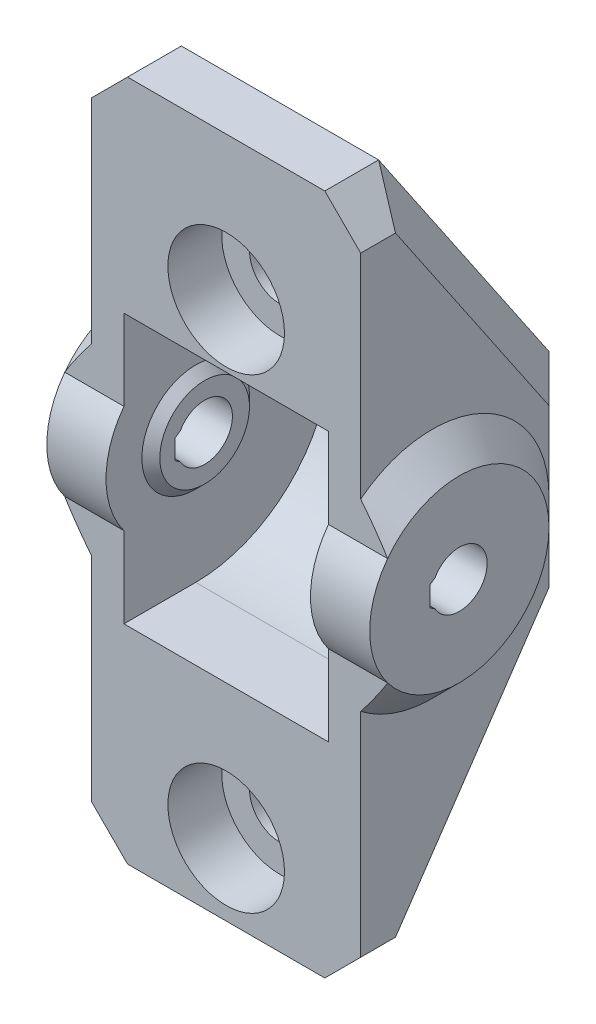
ISO-10303-21;
HEADER;
FILE_DESCRIPTION(('STEP AP214'),'2;1');
FILE_NAME('part.step','',(''),(''),'','','');
FILE_SCHEMA(('AUTOMOTIVE_DESIGN { 1 0 10303 214 1 1 1 1 }'));
ENDSEC;
DATA;
#1=APPLICATION_CONTEXT('core data for automotive mechanical design processes');
#2=APPLICATION_PROTOCOL_DEFINITION('international standard','automotive_design',2000,#1);
#3=PRODUCT_CONTEXT('',#1,'mechanical');
#4=PRODUCT('Part','Part','',(#3));
#5=PRODUCT_RELATED_PRODUCT_CATEGORY('part','',(#4));
#6=PRODUCT_DEFINITION_FORMATION('','',#4);
#7=PRODUCT_DEFINITION_CONTEXT('part definition',#1,'design');
#8=PRODUCT_DEFINITION('design','',#6,#7);
#9=PRODUCT_DEFINITION_SHAPE('','',#8);
#10=(LENGTH_UNIT() NAMED_UNIT(*) SI_UNIT(.MILLI.,.METRE.));
#11=(NAMED_UNIT(*) PLANE_ANGLE_UNIT() SI_UNIT($,.RADIAN.));
#12=(NAMED_UNIT(*) SI_UNIT($,.STERADIAN.) SOLID_ANGLE_UNIT());
#13=UNCERTAINTY_MEASURE_WITH_UNIT(LENGTH_MEASURE(1.E-05),#10,'distance_accuracy_value','');
#14=(GEOMETRIC_REPRESENTATION_CONTEXT(3) GLOBAL_UNCERTAINTY_ASSIGNED_CONTEXT((#13)) GLOBAL_UNIT_ASSIGNED_CONTEXT((#10,
#11,#12)) REPRESENTATION_CONTEXT('',''));
#15=CARTESIAN_POINT('',(0.,0.,0.));
#16=DIRECTION('',(0.,0.,1.));
#17=DIRECTION('',(1.,0.,0.));
#18=AXIS2_PLACEMENT_3D('',#15,#16,#17);
#19=CARTESIAN_POINT('',(7.5,19.,16.));
#20=DIRECTION('',(-1.,0.,0.));
#21=DIRECTION('',(0.,-1.,0.));
#22=AXIS2_PLACEMENT_3D('',#19,#20,#21);
#23=PLANE('',#22);
#24=DIRECTION('',(0.,0.827475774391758,0.561501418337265));
#25=VECTOR('',#24,1.);
#26=CARTESIAN_POINT('',(7.5,19.2708836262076,15.6008030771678));
#27=LINE('',#26,#25);
#28=CARTESIAN_POINT('',(7.5,4.38548961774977,5.49999999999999));
#29=VERTEX_POINT('',#28);
#30=CARTESIAN_POINT('',(7.5,17.,14.0598463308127));
#31=VERTEX_POINT('',#30);
#32=EDGE_CURVE('E516',#29,#31,#27,.T.);
#33=ORIENTED_EDGE('',*,*,#32,.T.);
#34=DIRECTION('',(0.,0.,1.));
#35=VECTOR('',#34,1.);
#36=CARTESIAN_POINT('',(7.5,17.,16.));
#37=LINE('',#36,#35);
#38=CARTESIAN_POINT('',(7.5,17.,16.));
#39=VERTEX_POINT('',#38);
#40=EDGE_CURVE('E518',#31,#39,#37,.T.);
#41=ORIENTED_EDGE('',*,*,#40,.T.);
#42=DIRECTION('',(0.,1.,0.));
#43=VECTOR('',#42,1.);
#44=CARTESIAN_POINT('',(7.5,19.,16.));
#45=LINE('',#44,#43);
#46=CARTESIAN_POINT('',(7.5,5.12347538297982,16.));
#47=VERTEX_POINT('',#46);
#48=EDGE_CURVE('E389',#47,#39,#45,.T.);
#49=ORIENTED_EDGE('',*,*,#48,.F.);
#50=CARTESIAN_POINT('',(7.5,0.,12.));
#51=DIRECTION('',(-1.,0.,0.));
#52=DIRECTION('',(0.,-1.,0.));
#53=AXIS2_PLACEMENT_3D('',#50,#51,#52);
#54=CIRCLE('',#53,6.50000000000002);
#55=CARTESIAN_POINT('',(7.5,0.,5.49999999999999));
#56=VERTEX_POINT('',#55);
#57=EDGE_CURVE('E409',#47,#56,#54,.T.);
#58=ORIENTED_EDGE('',*,*,#57,.T.);
#59=DIRECTION('',(0.,1.,0.));
#60=VECTOR('',#59,1.);
#61=CARTESIAN_POINT('',(7.5,19.,5.49999999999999));
#62=LINE('',#61,#60);
#63=EDGE_CURVE('E514',#56,#29,#62,.T.);
#64=ORIENTED_EDGE('',*,*,#63,.T.);
#65=EDGE_LOOP('',(#33,#41,#49,#58,#64));
#66=FACE_BOUND('',#65,.T.);
#67=ADVANCED_FACE('F39',(#66),#23,.F.);
#68=CARTESIAN_POINT('',(-7.5,19.,16.));
#69=DIRECTION('',(1.,0.,0.));
#70=DIRECTION('',(0.,1.,0.));
#71=AXIS2_PLACEMENT_3D('',#68,#69,#70);
#72=PLANE('',#71);
#73=DIRECTION('',(0.,-0.827475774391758,0.561501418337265));
#74=VECTOR('',#73,1.);
#75=CARTESIAN_POINT('',(-7.49999999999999,-17.8769971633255,14.6549515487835));
#76=LINE('',#75,#74);
#77=CARTESIAN_POINT('',(-7.5,-4.38548961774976,5.5));
#78=VERTEX_POINT('',#77);
#79=CARTESIAN_POINT('',(-7.49999999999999,-17.,14.0598463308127));
#80=VERTEX_POINT('',#79);
#81=EDGE_CURVE('E479',#78,#80,#76,.T.);
#82=ORIENTED_EDGE('',*,*,#81,.T.);
#83=DIRECTION('',(0.,0.,1.));
#84=VECTOR('',#83,1.);
#85=CARTESIAN_POINT('',(-7.49999999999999,-17.,16.));
#86=LINE('',#85,#84);
#87=CARTESIAN_POINT('',(-7.49999999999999,-17.,16.));
#88=VERTEX_POINT('',#87);
#89=EDGE_CURVE('E481',#80,#88,#86,.T.);
#90=ORIENTED_EDGE('',*,*,#89,.T.);
#91=DIRECTION('',(0.,-1.,0.));
#92=VECTOR('',#91,1.);
#93=CARTESIAN_POINT('',(-7.5,19.,16.));
#94=LINE('',#93,#92);
#95=CARTESIAN_POINT('',(-7.5,-5.12347538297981,16.));
#96=VERTEX_POINT('',#95);
#97=EDGE_CURVE('E376',#96,#88,#94,.T.);
#98=ORIENTED_EDGE('',*,*,#97,.F.);
#99=CARTESIAN_POINT('',(-7.5,0.,12.));
#100=DIRECTION('',(1.,0.,0.));
#101=DIRECTION('',(0.,1.,0.));
#102=AXIS2_PLACEMENT_3D('',#99,#100,#101);
#103=CIRCLE('',#102,6.50000000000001);
#104=CARTESIAN_POINT('',(-7.5,0.,5.5));
#105=VERTEX_POINT('',#104);
#106=EDGE_CURVE('E413',#96,#105,#103,.T.);
#107=ORIENTED_EDGE('',*,*,#106,.T.);
#108=DIRECTION('',(0.,-1.,0.));
#109=VECTOR('',#108,1.);
#110=CARTESIAN_POINT('',(-7.5,19.,5.5));
#111=LINE('',#110,#109);
#112=EDGE_CURVE('E477',#105,#78,#111,.T.);
#113=ORIENTED_EDGE('',*,*,#112,.T.);
#114=EDGE_LOOP('',(#82,#90,#98,#107,#113));
#115=FACE_BOUND('',#114,.T.);
#116=ADVANCED_FACE('F585',(#115),#72,.F.);
#117=CARTESIAN_POINT('',(0.,0.,16.));
#118=DIRECTION('',(0.,0.,-1.));
#119=DIRECTION('',(-1.,0.,0.));
#120=AXIS2_PLACEMENT_3D('',#117,#118,#119);
#121=PLANE('',#120);
#122=CARTESIAN_POINT('',(0.,11.,16.));
#123=DIRECTION('',(0.,0.,1.));
#124=DIRECTION('',(1.,0.,0.));
#125=AXIS2_PLACEMENT_3D('',#122,#123,#124);
#126=CIRCLE('',#125,3.25);
#127=CARTESIAN_POINT('',(3.25,11.,16.));
#128=VERTEX_POINT('',#127);
#129=EDGE_CURVE('E321',#128,#128,#126,.T.);
#130=ORIENTED_EDGE('',*,*,#129,.F.);
#131=EDGE_LOOP('',(#130));
#132=FACE_BOUND('',#131,.T.);
#133=DIRECTION('',(-1.,0.,0.));
#134=VECTOR('',#133,1.);
#135=CARTESIAN_POINT('',(7.5,19.,16.));
#136=LINE('',#135,#134);
#137=CARTESIAN_POINT('',(5.5,19.,16.));
#138=VERTEX_POINT('',#137);
#139=CARTESIAN_POINT('',(-5.49999999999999,19.,16.));
#140=VERTEX_POINT('',#139);
#141=EDGE_CURVE('E393',#138,#140,#136,.T.);
#142=ORIENTED_EDGE('',*,*,#141,.T.);
#143=DIRECTION('',(0.707106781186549,0.707106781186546,0.));
#144=VECTOR('',#143,1.);
#145=CARTESIAN_POINT('',(-7.5,17.,16.));
#146=LINE('',#145,#144);
#147=CARTESIAN_POINT('',(-7.5,17.,16.));
#148=VERTEX_POINT('',#147);
#149=EDGE_CURVE('E506',#140,#148,#146,.F.);
#150=ORIENTED_EDGE('',*,*,#149,.T.);
#151=CARTESIAN_POINT('',(-7.5,5.12347538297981,16.));
#152=VERTEX_POINT('',#151);
#153=EDGE_CURVE('E384',#148,#152,#94,.T.);
#154=ORIENTED_EDGE('',*,*,#153,.T.);
#155=CARTESIAN_POINT('',(-7.5,5.12347538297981,16.));
#156=CARTESIAN_POINT('',(-7.56711714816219,5.03832196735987,16.));
#157=CARTESIAN_POINT('',(-7.63384766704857,4.9528635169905,16.));
#158=CARTESIAN_POINT('',(-7.76642428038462,4.78125929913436,16.));
#159=CARTESIAN_POINT('',(-7.83227034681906,4.6951135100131,16.));
#160=CARTESIAN_POINT('',(-8.02817951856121,4.43570850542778,16.));
#161=CARTESIAN_POINT('',(-8.15674680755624,4.26131350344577,16.));
#162=CARTESIAN_POINT('',(-8.40870004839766,3.90869296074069,16.));
#163=CARTESIAN_POINT('',(-8.53208403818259,3.73046600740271,16.));
#164=CARTESIAN_POINT('',(-8.71192373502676,3.45952365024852,16.));
#165=CARTESIAN_POINT('',(-8.77102477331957,3.36856455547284,16.));
#166=CARTESIAN_POINT('',(-8.88715085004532,3.18531455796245,16.));
#167=CARTESIAN_POINT('',(-8.94417559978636,3.09302347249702,16.));
#168=CARTESIAN_POINT('',(-8.99999999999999,2.99999999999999,16.));
#169=B_SPLINE_CURVE_WITH_KNOTS('',3,(#155,#156,#157,#158,#159,#160,#161,#162,#163,#164,#165,
#166,#167,#168),.UNSPECIFIED.,.F.,.F.,(4,2,2,2,2,2,4),(0.,0.325271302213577,0.650552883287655,
1.30047262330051,1.95063620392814,2.27603142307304,2.60147171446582),.UNSPECIFIED.);
#170=CARTESIAN_POINT('',(-9.,2.99999999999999,16.));
#171=VERTEX_POINT('',#170);
#172=EDGE_CURVE('E454',#152,#171,#169,.T.);
#173=ORIENTED_EDGE('',*,*,#172,.T.);
#174=DIRECTION('',(1.,0.,0.));
#175=VECTOR('',#174,1.);
#176=CARTESIAN_POINT('',(-32.1421356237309,2.99999999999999,16.));
#177=LINE('',#176,#175);
#178=CARTESIAN_POINT('',(-5.7,2.99999999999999,16.));
#179=VERTEX_POINT('',#178);
#180=EDGE_CURVE('E290',#171,#179,#177,.T.);
#181=ORIENTED_EDGE('',*,*,#180,.T.);
#182=DIRECTION('',(0.,-1.,0.));
#183=VECTOR('',#182,1.);
#184=CARTESIAN_POINT('',(-5.7,7.5,16.));
#185=LINE('',#184,#183);
#186=CARTESIAN_POINT('',(-5.7,7.5,16.));
#187=VERTEX_POINT('',#186);
#188=EDGE_CURVE('E357',#187,#179,#185,.T.);
#189=ORIENTED_EDGE('',*,*,#188,.F.);
#190=DIRECTION('',(1.,0.,0.));
#191=VECTOR('',#190,1.);
#192=CARTESIAN_POINT('',(-5.7,7.5,16.));
#193=LINE('',#192,#191);
#194=CARTESIAN_POINT('',(5.7,7.5,16.));
#195=VERTEX_POINT('',#194);
#196=EDGE_CURVE('E380',#187,#195,#193,.T.);
#197=ORIENTED_EDGE('',*,*,#196,.T.);
#198=DIRECTION('',(0.,-1.,0.));
#199=VECTOR('',#198,1.);
#200=CARTESIAN_POINT('',(5.7,7.5,16.));
#201=LINE('',#200,#199);
#202=CARTESIAN_POINT('',(5.7,2.99999999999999,16.));
#203=VERTEX_POINT('',#202);
#204=EDGE_CURVE('E370',#195,#203,#201,.T.);
#205=ORIENTED_EDGE('',*,*,#204,.T.);
#206=DIRECTION('',(-1.,0.,0.));
#207=VECTOR('',#206,1.);
#208=CARTESIAN_POINT('',(32.1421356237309,2.99999999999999,16.));
#209=LINE('',#208,#207);
#210=CARTESIAN_POINT('',(9.,2.99999999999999,16.));
#211=VERTEX_POINT('',#210);
#212=EDGE_CURVE('E300',#203,#211,#209,.F.);
#213=ORIENTED_EDGE('',*,*,#212,.T.);
#214=CARTESIAN_POINT('',(9.00000000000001,2.99999999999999,16.));
#215=CARTESIAN_POINT('',(8.94417559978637,3.09302347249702,16.));
#216=CARTESIAN_POINT('',(8.88715085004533,3.18531455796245,16.));
#217=CARTESIAN_POINT('',(8.77102477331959,3.36856455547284,16.));
#218=CARTESIAN_POINT('',(8.71192373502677,3.45952365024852,16.));
#219=CARTESIAN_POINT('',(8.5320840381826,3.73046600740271,16.));
#220=CARTESIAN_POINT('',(8.40870004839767,3.90869296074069,16.));
#221=CARTESIAN_POINT('',(8.15674680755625,4.26131350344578,16.));
#222=CARTESIAN_POINT('',(8.02817951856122,4.43570850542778,16.));
#223=CARTESIAN_POINT('',(7.83227034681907,4.6951135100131,16.));
#224=CARTESIAN_POINT('',(7.76642428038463,4.78125929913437,16.));
#225=CARTESIAN_POINT('',(7.63384766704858,4.95286351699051,16.));
#226=CARTESIAN_POINT('',(7.5671171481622,5.03832196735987,16.));
#227=CARTESIAN_POINT('',(7.5,5.12347538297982,16.));
#228=B_SPLINE_CURVE_WITH_KNOTS('',3,(#214,#215,#216,#217,#218,#219,#220,#221,#222,#223,#224,
#225,#226,#227),.UNSPECIFIED.,.F.,.F.,(4,2,2,2,2,2,4),(0.,0.325440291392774,0.650835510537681,
1.30099909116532,1.95091883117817,2.27620041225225,2.60147171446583),.UNSPECIFIED.);
#229=EDGE_CURVE('E425',#211,#47,#228,.T.);
#230=ORIENTED_EDGE('',*,*,#229,.T.);
#231=ORIENTED_EDGE('',*,*,#48,.T.);
#232=DIRECTION('',(0.707106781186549,-0.707106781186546,0.));
#233=VECTOR('',#232,1.);
#234=CARTESIAN_POINT('',(5.5,19.,16.));
#235=LINE('',#234,#233);
#236=EDGE_CURVE('E504',#39,#138,#235,.F.);
#237=ORIENTED_EDGE('',*,*,#236,.T.);
#238=EDGE_LOOP('',(#142,#150,#154,#173,#181,#189,#197,#205,#213,#230,#231,#237));
#239=FACE_BOUND('',#238,.T.);
#240=ADVANCED_FACE('F592',(#132,#239),#121,.F.);
#241=DIRECTION('',(0.,-0.827475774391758,-0.561501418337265));
#242=VECTOR('',#241,1.);
#243=CARTESIAN_POINT('',(-7.5,19.2708836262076,15.6008030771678));
#244=LINE('',#243,#242);
#245=CARTESIAN_POINT('',(-7.5,17.,14.0598463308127));
#246=VERTEX_POINT('',#245);
#247=CARTESIAN_POINT('',(-7.5,4.38548961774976,5.5));
#248=VERTEX_POINT('',#247);
#249=EDGE_CURVE('E473',#246,#248,#244,.T.);
#250=ORIENTED_EDGE('',*,*,#249,.T.);
#251=DIRECTION('',(0.,-1.,0.));
#252=VECTOR('',#251,1.);
#253=CARTESIAN_POINT('',(-7.5,19.,5.5));
#254=LINE('',#253,#252);
#255=EDGE_CURVE('E475',#248,#105,#254,.T.);
#256=ORIENTED_EDGE('',*,*,#255,.T.);
#257=EDGE_CURVE('E412',#105,#152,#103,.T.);
#258=ORIENTED_EDGE('',*,*,#257,.T.);
#259=ORIENTED_EDGE('',*,*,#153,.F.);
#260=DIRECTION('',(0.,0.,-1.));
#261=VECTOR('',#260,1.);
#262=CARTESIAN_POINT('',(-7.5,17.,16.));
#263=LINE('',#262,#261);
#264=EDGE_CURVE('E471',#148,#246,#263,.T.);
#265=ORIENTED_EDGE('',*,*,#264,.T.);
#266=EDGE_LOOP('',(#250,#256,#258,#259,#265));
#267=FACE_BOUND('',#266,.T.);
#268=ADVANCED_FACE('F595',(#267),#72,.F.);
#269=CARTESIAN_POINT('',(7.50000000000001,-19.,16.));
#270=DIRECTION('',(0.,1.,0.));
#271=DIRECTION('',(-1.,0.,0.));
#272=AXIS2_PLACEMENT_3D('',#269,#270,#271);
#273=PLANE('',#272);
#274=DIRECTION('',(1.,0.,0.));
#275=VECTOR('',#274,1.);
#276=CARTESIAN_POINT('',(7.50000000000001,-19.,16.));
#277=LINE('',#276,#275);
#278=CARTESIAN_POINT('',(-5.49999999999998,-19.,16.));
#279=VERTEX_POINT('',#278);
#280=CARTESIAN_POINT('',(5.5,-19.,16.));
#281=VERTEX_POINT('',#280);
#282=EDGE_CURVE('E386',#279,#281,#277,.T.);
#283=ORIENTED_EDGE('',*,*,#282,.F.);
#284=DIRECTION('',(0.,0.,-1.));
#285=VECTOR('',#284,1.);
#286=CARTESIAN_POINT('',(-5.49999999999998,-19.,16.));
#287=LINE('',#286,#285);
#288=CARTESIAN_POINT('',(-5.49999999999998,-19.,13.));
#289=VERTEX_POINT('',#288);
#290=EDGE_CURVE('E468',#279,#289,#287,.T.);
#291=ORIENTED_EDGE('',*,*,#290,.T.);
#292=DIRECTION('',(1.,0.,0.));
#293=VECTOR('',#292,1.);
#294=CARTESIAN_POINT('',(-7.5,-19.,13.));
#295=LINE('',#294,#293);
#296=CARTESIAN_POINT('',(5.5,-19.,13.));
#297=VERTEX_POINT('',#296);
#298=EDGE_CURVE('E308',#289,#297,#295,.T.);
#299=ORIENTED_EDGE('',*,*,#298,.T.);
#300=DIRECTION('',(0.,0.,1.));
#301=VECTOR('',#300,1.);
#302=CARTESIAN_POINT('',(5.5,-19.,16.));
#303=LINE('',#302,#301);
#304=EDGE_CURVE('E466',#297,#281,#303,.T.);
#305=ORIENTED_EDGE('',*,*,#304,.T.);
#306=EDGE_LOOP('',(#283,#291,#299,#305));
#307=FACE_BOUND('',#306,.T.);
#308=ADVANCED_FACE('F599',(#307),#273,.F.);
#309=DIRECTION('',(0.,0.827475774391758,-0.561501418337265));
#310=VECTOR('',#309,1.);
#311=CARTESIAN_POINT('',(7.5,-3.87699716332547,5.15495154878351));
#312=LINE('',#311,#310);
#313=CARTESIAN_POINT('',(7.50000000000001,-17.,14.0598463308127));
#314=VERTEX_POINT('',#313);
#315=CARTESIAN_POINT('',(7.5,-4.38548961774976,5.49999999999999));
#316=VERTEX_POINT('',#315);
#317=EDGE_CURVE('E510',#314,#316,#312,.T.);
#318=ORIENTED_EDGE('',*,*,#317,.T.);
#319=DIRECTION('',(0.,1.,0.));
#320=VECTOR('',#319,1.);
#321=CARTESIAN_POINT('',(7.5,19.,5.49999999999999));
#322=LINE('',#321,#320);
#323=EDGE_CURVE('E512',#316,#56,#322,.T.);
#324=ORIENTED_EDGE('',*,*,#323,.T.);
#325=CARTESIAN_POINT('',(7.5,-5.12347538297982,16.));
#326=VERTEX_POINT('',#325);
#327=EDGE_CURVE('E402',#56,#326,#54,.T.);
#328=ORIENTED_EDGE('',*,*,#327,.T.);
#329=CARTESIAN_POINT('',(7.50000000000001,-17.,16.));
#330=VERTEX_POINT('',#329);
#331=EDGE_CURVE('E390',#330,#326,#45,.T.);
#332=ORIENTED_EDGE('',*,*,#331,.F.);
#333=DIRECTION('',(0.,0.,-1.));
#334=VECTOR('',#333,1.);
#335=CARTESIAN_POINT('',(7.50000000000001,-17.,16.));
#336=LINE('',#335,#334);
#337=EDGE_CURVE('E508',#330,#314,#336,.T.);
#338=ORIENTED_EDGE('',*,*,#337,.T.);
#339=EDGE_LOOP('',(#318,#324,#328,#332,#338));
#340=FACE_BOUND('',#339,.T.);
#341=ADVANCED_FACE('F588',(#340),#23,.F.);
#342=CARTESIAN_POINT('',(0.,-15.,16.));
#343=DIRECTION('',(0.,0.,1.));
#344=DIRECTION('',(1.,0.,0.));
#345=AXIS2_PLACEMENT_3D('',#342,#343,#344);
#346=CYLINDRICAL_SURFACE('',#345,1.7);
#347=CARTESIAN_POINT('',(0.,-15.,13.));
#348=DIRECTION('',(0.,0.,1.));
#349=DIRECTION('',(1.,0.,0.));
#350=AXIS2_PLACEMENT_3D('',#347,#348,#349);
#351=CIRCLE('',#350,1.7);
#352=CARTESIAN_POINT('',(1.7,-15.,13.));
#353=VERTEX_POINT('',#352);
#354=EDGE_CURVE('E336',#353,#353,#351,.T.);
#355=ORIENTED_EDGE('',*,*,#354,.T.);
#356=EDGE_LOOP('',(#355));
#357=FACE_BOUND('',#356,.T.);
#358=CARTESIAN_POINT('',(0.,-15.,10.2857142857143));
#359=DIRECTION('',(0.,-0.561501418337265,-0.827475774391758));
#360=DIRECTION('',(0.,-0.827475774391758,0.561501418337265));
#361=AXIS2_PLACEMENT_3D('',#358,#359,#360);
#362=ELLIPSE('',#361,2.05444080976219,1.7);
#363=CARTESIAN_POINT('',(0.,-16.7,11.4392857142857));
#364=VERTEX_POINT('',#363);
#365=EDGE_CURVE('E311',#364,#364,#362,.F.);
#366=ORIENTED_EDGE('',*,*,#365,.F.);
#367=EDGE_LOOP('',(#366));
#368=FACE_BOUND('',#367,.T.);
#369=ADVANCED_FACE('F598',(#357,#368),#346,.F.);
#370=CARTESIAN_POINT('',(0.,-15.,16.));
#371=DIRECTION('',(0.,0.,1.));
#372=DIRECTION('',(1.,0.,0.));
#373=AXIS2_PLACEMENT_3D('',#370,#371,#372);
#374=CIRCLE('',#373,3.25);
#375=CARTESIAN_POINT('',(3.25,-15.,16.));
#376=VERTEX_POINT('',#375);
#377=EDGE_CURVE('E330',#376,#376,#374,.T.);
#378=ORIENTED_EDGE('',*,*,#377,.F.);
#379=EDGE_LOOP('',(#378));
#380=FACE_BOUND('',#379,.T.);
#381=ORIENTED_EDGE('',*,*,#97,.T.);
#382=DIRECTION('',(-0.707106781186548,0.707106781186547,0.));
#383=VECTOR('',#382,1.);
#384=CARTESIAN_POINT('',(-5.49999999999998,-19.,16.));
#385=LINE('',#384,#383);
#386=EDGE_CURVE('E485',#88,#279,#385,.F.);
#387=ORIENTED_EDGE('',*,*,#386,.T.);
#388=ORIENTED_EDGE('',*,*,#282,.T.);
#389=DIRECTION('',(-0.707106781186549,-0.707106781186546,0.));
#390=VECTOR('',#389,1.);
#391=CARTESIAN_POINT('',(7.50000000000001,-17.,16.));
#392=LINE('',#391,#390);
#393=EDGE_CURVE('E483',#281,#330,#392,.F.);
#394=ORIENTED_EDGE('',*,*,#393,.T.);
#395=ORIENTED_EDGE('',*,*,#331,.T.);
#396=CARTESIAN_POINT('',(7.5,-5.12347538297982,16.));
#397=CARTESIAN_POINT('',(7.5671171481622,-5.03832196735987,16.));
#398=CARTESIAN_POINT('',(7.63384766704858,-4.95286351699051,16.));
#399=CARTESIAN_POINT('',(7.76642428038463,-4.78125929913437,16.));
#400=CARTESIAN_POINT('',(7.83227034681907,-4.6951135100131,16.));
#401=CARTESIAN_POINT('',(8.02817951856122,-4.43570850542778,16.));
#402=CARTESIAN_POINT('',(8.15674680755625,-4.26131350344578,16.));
#403=CARTESIAN_POINT('',(8.40870004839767,-3.90869296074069,16.));
#404=CARTESIAN_POINT('',(8.5320840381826,-3.73046600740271,16.));
#405=CARTESIAN_POINT('',(8.71192373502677,-3.45952365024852,16.));
#406=CARTESIAN_POINT('',(8.77102477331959,-3.36856455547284,16.));
#407=CARTESIAN_POINT('',(8.88715085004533,-3.18531455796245,16.));
#408=CARTESIAN_POINT('',(8.94417559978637,-3.09302347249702,16.));
#409=CARTESIAN_POINT('',(9.00000000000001,-2.99999999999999,16.));
#410=B_SPLINE_CURVE_WITH_KNOTS('',3,(#396,#397,#398,#399,#400,#401,#402,#403,#404,#405,#406,
#407,#408,#409),.UNSPECIFIED.,.F.,.F.,(4,2,2,2,2,2,4),(0.,0.32527130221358,0.650552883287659,
1.30047262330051,1.95063620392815,2.27603142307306,2.60147171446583),.UNSPECIFIED.);
#411=CARTESIAN_POINT('',(9.,-2.99999999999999,16.));
#412=VERTEX_POINT('',#411);
#413=EDGE_CURVE('E416',#326,#412,#410,.T.);
#414=ORIENTED_EDGE('',*,*,#413,.T.);
#415=DIRECTION('',(-1.,0.,0.));
#416=VECTOR('',#415,1.);
#417=CARTESIAN_POINT('',(32.1421356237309,-2.99999999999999,16.));
#418=LINE('',#417,#416);
#419=CARTESIAN_POINT('',(5.7,-2.99999999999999,16.));
#420=VERTEX_POINT('',#419);
#421=EDGE_CURVE('E304',#412,#420,#418,.T.);
#422=ORIENTED_EDGE('',*,*,#421,.T.);
#423=CARTESIAN_POINT('',(5.7,-7.5,16.));
#424=VERTEX_POINT('',#423);
#425=EDGE_CURVE('E369',#420,#424,#201,.T.);
#426=ORIENTED_EDGE('',*,*,#425,.T.);
#427=DIRECTION('',(1.,0.,0.));
#428=VECTOR('',#427,1.);
#429=CARTESIAN_POINT('',(-5.7,-7.5,16.));
#430=LINE('',#429,#428);
#431=CARTESIAN_POINT('',(-5.7,-7.5,16.));
#432=VERTEX_POINT('',#431);
#433=EDGE_CURVE('E377',#432,#424,#430,.T.);
#434=ORIENTED_EDGE('',*,*,#433,.F.);
#435=CARTESIAN_POINT('',(-5.7,-2.99999999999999,16.));
#436=VERTEX_POINT('',#435);
#437=EDGE_CURVE('E356',#436,#432,#185,.T.);
#438=ORIENTED_EDGE('',*,*,#437,.F.);
#439=DIRECTION('',(1.,0.,0.));
#440=VECTOR('',#439,1.);
#441=CARTESIAN_POINT('',(-32.1421356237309,-2.99999999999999,16.));
#442=LINE('',#441,#440);
#443=CARTESIAN_POINT('',(-9.,-2.99999999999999,16.));
#444=VERTEX_POINT('',#443);
#445=EDGE_CURVE('E288',#436,#444,#442,.F.);
#446=ORIENTED_EDGE('',*,*,#445,.T.);
#447=CARTESIAN_POINT('',(-8.99999999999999,-2.99999999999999,16.));
#448=CARTESIAN_POINT('',(-8.94417559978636,-3.09302347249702,16.));
#449=CARTESIAN_POINT('',(-8.88715085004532,-3.18531455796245,16.));
#450=CARTESIAN_POINT('',(-8.77102477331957,-3.36856455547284,16.));
#451=CARTESIAN_POINT('',(-8.71192373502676,-3.45952365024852,16.));
#452=CARTESIAN_POINT('',(-8.53208403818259,-3.73046600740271,16.));
#453=CARTESIAN_POINT('',(-8.40870004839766,-3.90869296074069,16.));
#454=CARTESIAN_POINT('',(-8.15674680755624,-4.26131350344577,16.));
#455=CARTESIAN_POINT('',(-8.02817951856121,-4.43570850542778,16.));
#456=CARTESIAN_POINT('',(-7.83227034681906,-4.6951135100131,16.));
#457=CARTESIAN_POINT('',(-7.76642428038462,-4.78125929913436,16.));
#458=CARTESIAN_POINT('',(-7.63384766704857,-4.9528635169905,16.));
#459=CARTESIAN_POINT('',(-7.56711714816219,-5.03832196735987,16.));
#460=CARTESIAN_POINT('',(-7.5,-5.12347538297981,16.));
#461=B_SPLINE_CURVE_WITH_KNOTS('',3,(#447,#448,#449,#450,#451,#452,#453,#454,#455,#456,#457,
#458,#459,#460),.UNSPECIFIED.,.F.,.F.,(4,2,2,2,2,2,4),(0.,0.325440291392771,0.650835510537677,
1.30099909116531,1.95091883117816,2.27620041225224,2.60147171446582),.UNSPECIFIED.);
#462=EDGE_CURVE('E460',#444,#96,#461,.T.);
#463=ORIENTED_EDGE('',*,*,#462,.T.);
#464=EDGE_LOOP('',(#381,#387,#388,#394,#395,#414,#422,#426,#434,#438,#446,#463));
#465=FACE_BOUND('',#464,.T.);
#466=ADVANCED_FACE('F431',(#380,#465),#121,.F.);
#467=CARTESIAN_POINT('',(7.5,19.,16.));
#468=DIRECTION('',(0.,-1.,0.));
#469=DIRECTION('',(1.,0.,0.));
#470=AXIS2_PLACEMENT_3D('',#467,#468,#469);
#471=PLANE('',#470);
#472=DIRECTION('',(1.,0.,0.));
#473=VECTOR('',#472,1.);
#474=CARTESIAN_POINT('',(-7.5,19.,13.));
#475=LINE('',#474,#473);
#476=CARTESIAN_POINT('',(-5.49999999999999,19.,13.));
#477=VERTEX_POINT('',#476);
#478=CARTESIAN_POINT('',(5.5,19.,13.));
#479=VERTEX_POINT('',#478);
#480=EDGE_CURVE('E318',#477,#479,#475,.T.);
#481=ORIENTED_EDGE('',*,*,#480,.F.);
#482=DIRECTION('',(0.,0.,1.));
#483=VECTOR('',#482,1.);
#484=CARTESIAN_POINT('',(-5.49999999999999,19.,16.));
#485=LINE('',#484,#483);
#486=EDGE_CURVE('E502',#477,#140,#485,.T.);
#487=ORIENTED_EDGE('',*,*,#486,.T.);
#488=ORIENTED_EDGE('',*,*,#141,.F.);
#489=DIRECTION('',(0.,0.,-1.));
#490=VECTOR('',#489,1.);
#491=CARTESIAN_POINT('',(5.5,19.,16.));
#492=LINE('',#491,#490);
#493=EDGE_CURVE('E499',#138,#479,#492,.T.);
#494=ORIENTED_EDGE('',*,*,#493,.T.);
#495=EDGE_LOOP('',(#481,#487,#488,#494));
#496=FACE_BOUND('',#495,.T.);
#497=ADVANCED_FACE('F685',(#496),#471,.F.);
#498=CARTESIAN_POINT('',(-5.7,0.,12.));
#499=DIRECTION('',(1.,0.,0.));
#500=DIRECTION('',(0.,0.,-1.));
#501=AXIS2_PLACEMENT_3D('',#498,#499,#500);
#502=CYLINDRICAL_SURFACE('',#501,7.5);
#503=CARTESIAN_POINT('',(5.7,0.,12.));
#504=DIRECTION('',(1.,0.,0.));
#505=DIRECTION('',(0.,0.,-1.));
#506=AXIS2_PLACEMENT_3D('',#503,#504,#505);
#507=CIRCLE('',#506,7.5);
#508=CARTESIAN_POINT('',(5.7,-7.5,12.));
#509=VERTEX_POINT('',#508);
#510=CARTESIAN_POINT('',(5.7,7.5,12.));
#511=VERTEX_POINT('',#510);
#512=EDGE_CURVE('E348',#509,#511,#507,.T.);
#513=ORIENTED_EDGE('',*,*,#512,.T.);
#514=DIRECTION('',(1.,0.,0.));
#515=VECTOR('',#514,1.);
#516=CARTESIAN_POINT('',(-5.7,7.5,12.));
#517=LINE('',#516,#515);
#518=CARTESIAN_POINT('',(-5.7,7.5,12.));
#519=VERTEX_POINT('',#518);
#520=EDGE_CURVE('E363',#519,#511,#517,.T.);
#521=ORIENTED_EDGE('',*,*,#520,.F.);
#522=CARTESIAN_POINT('',(-5.7,0.,12.));
#523=DIRECTION('',(1.,0.,0.));
#524=DIRECTION('',(0.,0.,-1.));
#525=AXIS2_PLACEMENT_3D('',#522,#523,#524);
#526=CIRCLE('',#525,7.5);
#527=CARTESIAN_POINT('',(-5.7,-7.5,12.));
#528=VERTEX_POINT('',#527);
#529=EDGE_CURVE('E349',#528,#519,#526,.T.);
#530=ORIENTED_EDGE('',*,*,#529,.F.);
#531=DIRECTION('',(1.,0.,0.));
#532=VECTOR('',#531,1.);
#533=CARTESIAN_POINT('',(-5.7,-7.5,12.));
#534=LINE('',#533,#532);
#535=EDGE_CURVE('E374',#528,#509,#534,.T.);
#536=ORIENTED_EDGE('',*,*,#535,.T.);
#537=EDGE_LOOP('',(#513,#521,#530,#536));
#538=FACE_BOUND('',#537,.T.);
#539=ADVANCED_FACE('F939',(#538),#502,.F.);
#540=CARTESIAN_POINT('',(-5.7,-7.5,12.));
#541=DIRECTION('',(0.,-1.,0.));
#542=DIRECTION('',(0.,0.,-1.));
#543=AXIS2_PLACEMENT_3D('',#540,#541,#542);
#544=PLANE('',#543);
#545=DIRECTION('',(0.,0.,-1.));
#546=VECTOR('',#545,1.);
#547=CARTESIAN_POINT('',(5.7,-7.5,12.));
#548=LINE('',#547,#546);
#549=EDGE_CURVE('E353',#424,#509,#548,.T.);
#550=ORIENTED_EDGE('',*,*,#549,.T.);
#551=ORIENTED_EDGE('',*,*,#535,.F.);
#552=DIRECTION('',(0.,0.,-1.));
#553=VECTOR('',#552,1.);
#554=CARTESIAN_POINT('',(-5.7,-7.5,12.));
#555=LINE('',#554,#553);
#556=EDGE_CURVE('E360',#432,#528,#555,.T.);
#557=ORIENTED_EDGE('',*,*,#556,.F.);
#558=ORIENTED_EDGE('',*,*,#433,.T.);
#559=EDGE_LOOP('',(#550,#551,#557,#558));
#560=FACE_BOUND('',#559,.T.);
#561=ADVANCED_FACE('F1074',(#560),#544,.F.);
#562=CARTESIAN_POINT('',(-5.7,7.5,12.));
#563=DIRECTION('',(0.,1.,0.));
#564=DIRECTION('',(0.,0.,1.));
#565=AXIS2_PLACEMENT_3D('',#562,#563,#564);
#566=PLANE('',#565);
#567=DIRECTION('',(0.,0.,1.));
#568=VECTOR('',#567,1.);
#569=CARTESIAN_POINT('',(5.7,7.5,12.));
#570=LINE('',#569,#568);
#571=EDGE_CURVE('E366',#511,#195,#570,.T.);
#572=ORIENTED_EDGE('',*,*,#571,.T.);
#573=ORIENTED_EDGE('',*,*,#196,.F.);
#574=DIRECTION('',(0.,0.,1.));
#575=VECTOR('',#574,1.);
#576=CARTESIAN_POINT('',(-5.7,7.5,12.));
#577=LINE('',#576,#575);
#578=EDGE_CURVE('E352',#519,#187,#577,.T.);
#579=ORIENTED_EDGE('',*,*,#578,.F.);
#580=ORIENTED_EDGE('',*,*,#520,.T.);
#581=EDGE_LOOP('',(#572,#573,#579,#580));
#582=FACE_BOUND('',#581,.T.);
#583=ADVANCED_FACE('F580',(#582),#566,.F.);
#584=CARTESIAN_POINT('',(-5.7,0.,12.));
#585=DIRECTION('',(1.,0.,0.));
#586=DIRECTION('',(0.,0.,-1.));
#587=AXIS2_PLACEMENT_3D('',#584,#585,#586);
#588=PLANE('',#587);
#589=ORIENTED_EDGE('',*,*,#188,.T.);
#590=CARTESIAN_POINT('',(-5.7,0.,12.));
#591=DIRECTION('',(1.,0.,0.));
#592=DIRECTION('',(0.,0.,-1.));
#593=AXIS2_PLACEMENT_3D('',#590,#591,#592);
#594=CIRCLE('',#593,5.);
#595=EDGE_CURVE('E283',#179,#436,#594,.T.);
#596=ORIENTED_EDGE('',*,*,#595,.T.);
#597=ORIENTED_EDGE('',*,*,#437,.T.);
#598=ORIENTED_EDGE('',*,*,#556,.T.);
#599=ORIENTED_EDGE('',*,*,#529,.T.);
#600=ORIENTED_EDGE('',*,*,#578,.T.);
#601=EDGE_LOOP('',(#589,#596,#597,#598,#599,#600));
#602=FACE_BOUND('',#601,.T.);
#603=CARTESIAN_POINT('',(-5.7,0.,12.));
#604=DIRECTION('',(1.,0.,0.));
#605=DIRECTION('',(0.,0.,-1.));
#606=AXIS2_PLACEMENT_3D('',#603,#604,#605);
#607=CIRCLE('',#606,2.99999999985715);
#608=CARTESIAN_POINT('',(-5.7,0.,9.00000000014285));
#609=VERTEX_POINT('',#608);
#610=EDGE_CURVE('E396',#609,#609,#607,.F.);
#611=ORIENTED_EDGE('',*,*,#610,.T.);
#612=EDGE_LOOP('',(#611));
#613=FACE_BOUND('',#612,.T.);
#614=ADVANCED_FACE('F574',(#602,#613),#588,.T.);
#615=CARTESIAN_POINT('',(5.7,0.,12.));
#616=DIRECTION('',(1.,0.,0.));
#617=DIRECTION('',(0.,0.,-1.));
#618=AXIS2_PLACEMENT_3D('',#615,#616,#617);
#619=PLANE('',#618);
#620=ORIENTED_EDGE('',*,*,#425,.F.);
#621=CARTESIAN_POINT('',(5.7,0.,12.));
#622=DIRECTION('',(-1.,0.,0.));
#623=DIRECTION('',(0.,0.,1.));
#624=AXIS2_PLACEMENT_3D('',#621,#622,#623);
#625=CIRCLE('',#624,5.);
#626=EDGE_CURVE('E294',#420,#203,#625,.T.);
#627=ORIENTED_EDGE('',*,*,#626,.T.);
#628=ORIENTED_EDGE('',*,*,#204,.F.);
#629=ORIENTED_EDGE('',*,*,#571,.F.);
#630=ORIENTED_EDGE('',*,*,#512,.F.);
#631=ORIENTED_EDGE('',*,*,#549,.F.);
#632=EDGE_LOOP('',(#620,#627,#628,#629,#630,#631));
#633=FACE_BOUND('',#632,.T.);
#634=CARTESIAN_POINT('',(5.7,0.,12.));
#635=DIRECTION('',(1.,0.,0.));
#636=DIRECTION('',(0.,0.,-1.));
#637=AXIS2_PLACEMENT_3D('',#634,#635,#636);
#638=CIRCLE('',#637,3.00000000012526);
#639=CARTESIAN_POINT('',(5.7,0.,8.99999999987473));
#640=VERTEX_POINT('',#639);
#641=EDGE_CURVE('E399',#640,#640,#638,.T.);
#642=ORIENTED_EDGE('',*,*,#641,.T.);
#643=EDGE_LOOP('',(#642));
#644=FACE_BOUND('',#643,.T.);
#645=ADVANCED_FACE('F563',(#633,#644),#619,.F.);
#646=CARTESIAN_POINT('',(5.2,0.,12.));
#647=DIRECTION('',(1.,0.,0.));
#648=DIRECTION('',(0.,0.,-1.));
#649=AXIS2_PLACEMENT_3D('',#646,#647,#648);
#650=PLANE('',#649);
#651=CARTESIAN_POINT('',(5.2,0.,12.));
#652=DIRECTION('',(1.,0.,0.));
#653=DIRECTION('',(0.,0.,-1.));
#654=AXIS2_PLACEMENT_3D('',#651,#652,#653);
#655=CIRCLE('',#654,1.55);
#656=CARTESIAN_POINT('',(5.2,-0.751005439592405,13.3559095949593));
#657=VERTEX_POINT('',#656);
#658=CARTESIAN_POINT('',(5.2,0.751005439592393,13.3559095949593));
#659=VERTEX_POINT('',#658);
#660=EDGE_CURVE('E340',#657,#659,#655,.T.);
#661=ORIENTED_EDGE('',*,*,#660,.T.);
#662=DIRECTION('',(0.,0.568608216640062,-0.822608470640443));
#663=VECTOR('',#662,1.);
#664=CARTESIAN_POINT('',(5.2,0.547722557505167,13.65));
#665=LINE('',#664,#663);
#666=CARTESIAN_POINT('',(5.2,0.547722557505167,13.65));
#667=VERTEX_POINT('',#666);
#668=EDGE_CURVE('E14',#659,#667,#665,.F.);
#669=ORIENTED_EDGE('',*,*,#668,.T.);
#670=DIRECTION('',(0.,-1.,0.));
#671=VECTOR('',#670,1.);
#672=CARTESIAN_POINT('',(5.2,0.,13.65));
#673=LINE('',#672,#671);
#674=CARTESIAN_POINT('',(5.2,-0.547722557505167,13.65));
#675=VERTEX_POINT('',#674);
#676=EDGE_CURVE('E258',#667,#675,#673,.T.);
#677=ORIENTED_EDGE('',*,*,#676,.T.);
#678=DIRECTION('',(0.,0.568608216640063,0.822608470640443));
#679=VECTOR('',#678,1.);
#680=CARTESIAN_POINT('',(5.2,-0.751005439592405,13.3559095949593));
#681=LINE('',#680,#679);
#682=EDGE_CURVE('E47',#675,#657,#681,.F.);
#683=ORIENTED_EDGE('',*,*,#682,.T.);
#684=EDGE_LOOP('',(#661,#669,#677,#683));
#685=FACE_BOUND('',#684,.T.);
#686=CARTESIAN_POINT('',(5.2,0.,12.));
#687=DIRECTION('',(1.,0.,0.));
#688=DIRECTION('',(0.,0.,-1.));
#689=AXIS2_PLACEMENT_3D('',#686,#687,#688);
#690=CIRCLE('',#689,2.5);
#691=CARTESIAN_POINT('',(5.2,0.,9.5));
#692=VERTEX_POINT('',#691);
#693=EDGE_CURVE('E342',#692,#692,#690,.T.);
#694=ORIENTED_EDGE('',*,*,#693,.F.);
#695=EDGE_LOOP('',(#694));
#696=FACE_BOUND('',#695,.T.);
#697=ADVANCED_FACE('F559',(#685,#696),#650,.F.);
#698=CARTESIAN_POINT('',(-5.2,0.,12.));
#699=DIRECTION('',(1.,0.,0.));
#700=DIRECTION('',(0.,0.,-1.));
#701=AXIS2_PLACEMENT_3D('',#698,#699,#700);
#702=PLANE('',#701);
#703=CARTESIAN_POINT('',(-5.2,0.,12.));
#704=DIRECTION('',(1.,0.,0.));
#705=DIRECTION('',(0.,0.,-1.));
#706=AXIS2_PLACEMENT_3D('',#703,#704,#705);
#707=CIRCLE('',#706,1.55);
#708=CARTESIAN_POINT('',(-5.2,-0.751005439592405,13.3559095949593));
#709=VERTEX_POINT('',#708);
#710=CARTESIAN_POINT('',(-5.2,0.751005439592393,13.3559095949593));
#711=VERTEX_POINT('',#710);
#712=EDGE_CURVE('E339',#709,#711,#707,.T.);
#713=ORIENTED_EDGE('',*,*,#712,.F.);
#714=DIRECTION('',(0.,-0.568608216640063,-0.822608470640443));
#715=VECTOR('',#714,1.);
#716=CARTESIAN_POINT('',(-5.2,-1.14240966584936,12.7896630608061));
#717=LINE('',#716,#715);
#718=CARTESIAN_POINT('',(-5.2,-0.547722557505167,13.65));
#719=VERTEX_POINT('',#718);
#720=EDGE_CURVE('E547',#709,#719,#717,.F.);
#721=ORIENTED_EDGE('',*,*,#720,.T.);
#722=DIRECTION('',(0.,-1.,0.));
#723=VECTOR('',#722,1.);
#724=CARTESIAN_POINT('',(-5.2,0.,13.65));
#725=LINE('',#724,#723);
#726=CARTESIAN_POINT('',(-5.2,0.547722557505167,13.65));
#727=VERTEX_POINT('',#726);
#728=EDGE_CURVE('E270',#727,#719,#725,.T.);
#729=ORIENTED_EDGE('',*,*,#728,.F.);
#730=DIRECTION('',(0.,-0.568608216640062,0.822608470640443));
#731=VECTOR('',#730,1.);
#732=CARTESIAN_POINT('',(-5.2,1.14240966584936,12.7896630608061));
#733=LINE('',#732,#731);
#734=EDGE_CURVE('E545',#727,#711,#733,.F.);
#735=ORIENTED_EDGE('',*,*,#734,.T.);
#736=EDGE_LOOP('',(#713,#721,#729,#735));
#737=FACE_BOUND('',#736,.T.);
#738=CARTESIAN_POINT('',(-5.2,0.,12.));
#739=DIRECTION('',(1.,0.,0.));
#740=DIRECTION('',(0.,0.,-1.));
#741=AXIS2_PLACEMENT_3D('',#738,#739,#740);
#742=CIRCLE('',#741,2.5);
#743=CARTESIAN_POINT('',(-5.2,0.,9.5));
#744=VERTEX_POINT('',#743);
#745=EDGE_CURVE('E345',#744,#744,#742,.F.);
#746=ORIENTED_EDGE('',*,*,#745,.F.);
#747=EDGE_LOOP('',(#746));
#748=FACE_BOUND('',#747,.T.);
#749=ADVANCED_FACE('F562',(#737,#748),#702,.T.);
#750=CARTESIAN_POINT('',(-5.20000000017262,0.,12.));
#751=DIRECTION('',(-1.,0.,0.));
#752=DIRECTION('',(0.,0.,1.));
#753=AXIS2_PLACEMENT_3D('',#750,#751,#752);
#754=CONICAL_SURFACE('',#753,2.5,0.785398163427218);
#755=ORIENTED_EDGE('',*,*,#610,.F.);
#756=EDGE_LOOP('',(#755));
#757=FACE_BOUND('',#756,.T.);
#758=ORIENTED_EDGE('',*,*,#745,.T.);
#759=EDGE_LOOP('',(#758));
#760=FACE_BOUND('',#759,.T.);
#761=ADVANCED_FACE('F570',(#757,#760),#754,.T.);
#762=CARTESIAN_POINT('',(5.69999999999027,0.,12.));
#763=DIRECTION('',(1.,0.,0.));
#764=DIRECTION('',(0.,0.,-1.));
#765=AXIS2_PLACEMENT_3D('',#762,#763,#764);
#766=CONICAL_SURFACE('',#765,3.00000000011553,0.785398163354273);
#767=ORIENTED_EDGE('',*,*,#693,.T.);
#768=EDGE_LOOP('',(#767));
#769=FACE_BOUND('',#768,.T.);
#770=ORIENTED_EDGE('',*,*,#641,.F.);
#771=EDGE_LOOP('',(#770));
#772=FACE_BOUND('',#771,.T.);
#773=ADVANCED_FACE('F443',(#769,#772),#766,.T.);
#774=CARTESIAN_POINT('',(-7.5,0.,12.));
#775=DIRECTION('',(1.,0.,0.));
#776=DIRECTION('',(0.,0.,-1.));
#777=AXIS2_PLACEMENT_3D('',#774,#775,#776);
#778=CYLINDRICAL_SURFACE('',#777,1.55);
#779=CARTESIAN_POINT('',(-9.,0.,12.));
#780=DIRECTION('',(1.,0.,0.));
#781=DIRECTION('',(0.,0.,-1.));
#782=AXIS2_PLACEMENT_3D('',#779,#780,#781);
#783=CIRCLE('',#782,1.55);
#784=CARTESIAN_POINT('',(-9.,0.751005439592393,13.3559095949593));
#785=VERTEX_POINT('',#784);
#786=CARTESIAN_POINT('',(-9.,-0.751005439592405,13.3559095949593));
#787=VERTEX_POINT('',#786);
#788=EDGE_CURVE('E281',#785,#787,#783,.F.);
#789=ORIENTED_EDGE('',*,*,#788,.T.);
#790=DIRECTION('',(1.,0.,0.));
#791=VECTOR('',#790,1.);
#792=CARTESIAN_POINT('',(-7.5,-0.751005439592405,13.3559095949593));
#793=LINE('',#792,#791);
#794=EDGE_CURVE('E542',#787,#709,#793,.T.);
#795=ORIENTED_EDGE('',*,*,#794,.T.);
#796=ORIENTED_EDGE('',*,*,#712,.T.);
#797=DIRECTION('',(1.,0.,0.));
#798=VECTOR('',#797,1.);
#799=CARTESIAN_POINT('',(-7.5,0.751005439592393,13.3559095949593));
#800=LINE('',#799,#798);
#801=EDGE_CURVE('E520',#711,#785,#800,.F.);
#802=ORIENTED_EDGE('',*,*,#801,.T.);
#803=EDGE_LOOP('',(#789,#795,#796,#802));
#804=FACE_BOUND('',#803,.T.);
#805=ADVANCED_FACE('F569',(#804),#778,.F.);
#806=CARTESIAN_POINT('',(9.,0.,12.));
#807=DIRECTION('',(1.,0.,0.));
#808=DIRECTION('',(0.,0.,-1.));
#809=AXIS2_PLACEMENT_3D('',#806,#807,#808);
#810=CIRCLE('',#809,1.55);
#811=CARTESIAN_POINT('',(9.,0.751005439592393,13.3559095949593));
#812=VERTEX_POINT('',#811);
#813=CARTESIAN_POINT('',(9.,-0.751005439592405,13.3559095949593));
#814=VERTEX_POINT('',#813);
#815=EDGE_CURVE('E297',#812,#814,#810,.F.);
#816=ORIENTED_EDGE('',*,*,#815,.F.);
#817=DIRECTION('',(1.,0.,0.));
#818=VECTOR('',#817,1.);
#819=CARTESIAN_POINT('',(-7.5,0.751005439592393,13.3559095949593));
#820=LINE('',#819,#818);
#821=EDGE_CURVE('E54',#812,#659,#820,.F.);
#822=ORIENTED_EDGE('',*,*,#821,.T.);
#823=ORIENTED_EDGE('',*,*,#660,.F.);
#824=DIRECTION('',(1.,0.,0.));
#825=VECTOR('',#824,1.);
#826=CARTESIAN_POINT('',(-7.5,-0.751005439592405,13.3559095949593));
#827=LINE('',#826,#825);
#828=EDGE_CURVE('E249',#657,#814,#827,.T.);
#829=ORIENTED_EDGE('',*,*,#828,.T.);
#830=EDGE_LOOP('',(#816,#822,#823,#829));
#831=FACE_BOUND('',#830,.T.);
#832=ADVANCED_FACE('F557',(#831),#778,.F.);
#833=CARTESIAN_POINT('',(1.7,-15.,13.));
#834=DIRECTION('',(0.,0.,-1.));
#835=DIRECTION('',(-1.,0.,0.));
#836=AXIS2_PLACEMENT_3D('',#833,#834,#835);
#837=PLANE('',#836);
#838=ORIENTED_EDGE('',*,*,#354,.F.);
#839=EDGE_LOOP('',(#838));
#840=FACE_BOUND('',#839,.T.);
#841=CARTESIAN_POINT('',(0.,-15.,13.));
#842=DIRECTION('',(0.,0.,1.));
#843=DIRECTION('',(1.,0.,0.));
#844=AXIS2_PLACEMENT_3D('',#841,#842,#843);
#845=CIRCLE('',#844,3.25);
#846=CARTESIAN_POINT('',(3.25,-15.,13.));
#847=VERTEX_POINT('',#846);
#848=EDGE_CURVE('E333',#847,#847,#845,.T.);
#849=ORIENTED_EDGE('',*,*,#848,.T.);
#850=EDGE_LOOP('',(#849));
#851=FACE_BOUND('',#850,.T.);
#852=ADVANCED_FACE('F793',(#840,#851),#837,.F.);
#853=CARTESIAN_POINT('',(0.,-15.,16.));
#854=DIRECTION('',(0.,0.,1.));
#855=DIRECTION('',(1.,0.,0.));
#856=AXIS2_PLACEMENT_3D('',#853,#854,#855);
#857=CYLINDRICAL_SURFACE('',#856,3.25);
#858=ORIENTED_EDGE('',*,*,#848,.F.);
#859=EDGE_LOOP('',(#858));
#860=FACE_BOUND('',#859,.T.);
#861=ORIENTED_EDGE('',*,*,#377,.T.);
#862=EDGE_LOOP('',(#861));
#863=FACE_BOUND('',#862,.T.);
#864=ADVANCED_FACE('F1020',(#860,#863),#857,.F.);
#865=CARTESIAN_POINT('',(0.,11.,16.));
#866=DIRECTION('',(0.,0.,1.));
#867=DIRECTION('',(1.,0.,0.));
#868=AXIS2_PLACEMENT_3D('',#865,#866,#867);
#869=CYLINDRICAL_SURFACE('',#868,1.7);
#870=CARTESIAN_POINT('',(0.,11.,7.57142857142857));
#871=DIRECTION('',(0.,-0.561501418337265,0.827475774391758));
#872=DIRECTION('',(0.,0.827475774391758,0.561501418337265));
#873=AXIS2_PLACEMENT_3D('',#870,#871,#872);
#874=ELLIPSE('',#873,2.05444080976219,1.7);
#875=CARTESIAN_POINT('',(0.,12.7,8.725));
#876=VERTEX_POINT('',#875);
#877=EDGE_CURVE('E317',#876,#876,#874,.F.);
#878=ORIENTED_EDGE('',*,*,#877,.T.);
#879=EDGE_LOOP('',(#878));
#880=FACE_BOUND('',#879,.T.);
#881=CARTESIAN_POINT('',(0.,11.,13.));
#882=DIRECTION('',(0.,0.,1.));
#883=DIRECTION('',(1.,0.,0.));
#884=AXIS2_PLACEMENT_3D('',#881,#882,#883);
#885=CIRCLE('',#884,1.7);
#886=CARTESIAN_POINT('',(1.7,11.,13.));
#887=VERTEX_POINT('',#886);
#888=EDGE_CURVE('E327',#887,#887,#885,.T.);
#889=ORIENTED_EDGE('',*,*,#888,.T.);
#890=EDGE_LOOP('',(#889));
#891=FACE_BOUND('',#890,.T.);
#892=ADVANCED_FACE('F1014',(#880,#891),#869,.F.);
#893=CARTESIAN_POINT('',(1.7,11.,13.));
#894=DIRECTION('',(0.,0.,-1.));
#895=DIRECTION('',(-1.,0.,0.));
#896=AXIS2_PLACEMENT_3D('',#893,#894,#895);
#897=PLANE('',#896);
#898=ORIENTED_EDGE('',*,*,#888,.F.);
#899=EDGE_LOOP('',(#898));
#900=FACE_BOUND('',#899,.T.);
#901=CARTESIAN_POINT('',(0.,11.,13.));
#902=DIRECTION('',(0.,0.,1.));
#903=DIRECTION('',(1.,0.,0.));
#904=AXIS2_PLACEMENT_3D('',#901,#902,#903);
#905=CIRCLE('',#904,3.25);
#906=CARTESIAN_POINT('',(3.25,11.,13.));
#907=VERTEX_POINT('',#906);
#908=EDGE_CURVE('E324',#907,#907,#905,.T.);
#909=ORIENTED_EDGE('',*,*,#908,.T.);
#910=EDGE_LOOP('',(#909));
#911=FACE_BOUND('',#910,.T.);
#912=ADVANCED_FACE('F1019',(#900,#911),#897,.F.);
#913=CARTESIAN_POINT('',(0.,11.,16.));
#914=DIRECTION('',(0.,0.,1.));
#915=DIRECTION('',(1.,0.,0.));
#916=AXIS2_PLACEMENT_3D('',#913,#914,#915);
#917=CYLINDRICAL_SURFACE('',#916,3.25);
#918=ORIENTED_EDGE('',*,*,#908,.F.);
#919=EDGE_LOOP('',(#918));
#920=FACE_BOUND('',#919,.T.);
#921=ORIENTED_EDGE('',*,*,#129,.T.);
#922=EDGE_LOOP('',(#921));
#923=FACE_BOUND('',#922,.T.);
#924=ADVANCED_FACE('F928',(#920,#923),#917,.F.);
#925=CARTESIAN_POINT('',(-7.5,5.,3.5));
#926=DIRECTION('',(0.,-0.561501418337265,0.827475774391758));
#927=DIRECTION('',(0.,-0.827475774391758,-0.561501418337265));
#928=AXIS2_PLACEMENT_3D('',#925,#926,#927);
#929=PLANE('',#928);
#930=DIRECTION('',(1.,0.,0.));
#931=VECTOR('',#930,1.);
#932=CARTESIAN_POINT('',(-7.5,5.,3.5));
#933=LINE('',#932,#931);
#934=CARTESIAN_POINT('',(-5.49999999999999,5.,3.5));
#935=VERTEX_POINT('',#934);
#936=CARTESIAN_POINT('',(5.5,5.,3.5));
#937=VERTEX_POINT('',#936);
#938=EDGE_CURVE('E314',#935,#937,#933,.T.);
#939=ORIENTED_EDGE('',*,*,#938,.F.);
#940=DIRECTION('',(0.,0.827475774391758,0.561501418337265));
#941=VECTOR('',#940,1.);
#942=CARTESIAN_POINT('',(-5.49999999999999,5.,3.5));
#943=LINE('',#942,#941);
#944=EDGE_CURVE('E497',#935,#477,#943,.T.);
#945=ORIENTED_EDGE('',*,*,#944,.T.);
#946=ORIENTED_EDGE('',*,*,#480,.T.);
#947=DIRECTION('',(0.,-0.827475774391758,-0.561501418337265));
#948=VECTOR('',#947,1.);
#949=CARTESIAN_POINT('',(5.5,5.,3.5));
#950=LINE('',#949,#948);
#951=EDGE_CURVE('E495',#479,#937,#950,.T.);
#952=ORIENTED_EDGE('',*,*,#951,.T.);
#953=EDGE_LOOP('',(#939,#945,#946,#952));
#954=FACE_BOUND('',#953,.T.);
#955=ORIENTED_EDGE('',*,*,#877,.F.);
#956=EDGE_LOOP('',(#955));
#957=FACE_BOUND('',#956,.T.);
#958=ADVANCED_FACE('F681',(#954,#957),#929,.F.);
#959=CARTESIAN_POINT('',(-7.5,0.,3.5));
#960=DIRECTION('',(0.,0.,1.));
#961=DIRECTION('',(1.,0.,0.));
#962=AXIS2_PLACEMENT_3D('',#959,#960,#961);
#963=PLANE('',#962);
#964=DIRECTION('',(1.,0.,0.));
#965=VECTOR('',#964,1.);
#966=CARTESIAN_POINT('',(-7.5,-5.,3.5));
#967=LINE('',#966,#965);
#968=CARTESIAN_POINT('',(-5.49999999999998,-5.,3.5));
#969=VERTEX_POINT('',#968);
#970=CARTESIAN_POINT('',(5.5,-5.,3.5));
#971=VERTEX_POINT('',#970);
#972=EDGE_CURVE('E307',#969,#971,#967,.T.);
#973=ORIENTED_EDGE('',*,*,#972,.F.);
#974=DIRECTION('',(0.,1.,0.));
#975=VECTOR('',#974,1.);
#976=CARTESIAN_POINT('',(-5.49999999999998,0.,3.5));
#977=LINE('',#976,#975);
#978=EDGE_CURVE('E493',#969,#935,#977,.T.);
#979=ORIENTED_EDGE('',*,*,#978,.T.);
#980=ORIENTED_EDGE('',*,*,#938,.T.);
#981=DIRECTION('',(0.,-1.,0.));
#982=VECTOR('',#981,1.);
#983=CARTESIAN_POINT('',(5.5,0.,3.5));
#984=LINE('',#983,#982);
#985=EDGE_CURVE('E491',#937,#971,#984,.T.);
#986=ORIENTED_EDGE('',*,*,#985,.T.);
#987=EDGE_LOOP('',(#973,#979,#980,#986));
#988=FACE_BOUND('',#987,.T.);
#989=ADVANCED_FACE('F648',(#988),#963,.F.);
#990=CARTESIAN_POINT('',(-7.5,-5.,3.5));
#991=DIRECTION('',(0.,-0.561501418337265,-0.827475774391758));
#992=DIRECTION('',(0.,0.827475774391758,-0.561501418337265));
#993=AXIS2_PLACEMENT_3D('',#990,#991,#992);
#994=PLANE('',#993);
#995=ORIENTED_EDGE('',*,*,#298,.F.);
#996=DIRECTION('',(0.,0.827475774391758,-0.561501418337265));
#997=VECTOR('',#996,1.);
#998=CARTESIAN_POINT('',(-5.49999999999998,-5.,3.5));
#999=LINE('',#998,#997);
#1000=EDGE_CURVE('E489',#289,#969,#999,.T.);
#1001=ORIENTED_EDGE('',*,*,#1000,.T.);
#1002=ORIENTED_EDGE('',*,*,#972,.T.);
#1003=DIRECTION('',(0.,-0.827475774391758,0.561501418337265));
#1004=VECTOR('',#1003,1.);
#1005=CARTESIAN_POINT('',(5.5,-19.,13.));
#1006=LINE('',#1005,#1004);
#1007=EDGE_CURVE('E487',#971,#297,#1006,.T.);
#1008=ORIENTED_EDGE('',*,*,#1007,.T.);
#1009=EDGE_LOOP('',(#995,#1001,#1002,#1008));
#1010=FACE_BOUND('',#1009,.T.);
#1011=ORIENTED_EDGE('',*,*,#365,.T.);
#1012=EDGE_LOOP('',(#1011));
#1013=FACE_BOUND('',#1012,.T.);
#1014=ADVANCED_FACE('F642',(#1010,#1013),#994,.T.);
#1015=CARTESIAN_POINT('',(32.1421356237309,0.,12.));
#1016=DIRECTION('',(-1.,0.,0.));
#1017=DIRECTION('',(0.,0.,1.));
#1018=AXIS2_PLACEMENT_3D('',#1015,#1016,#1017);
#1019=CYLINDRICAL_SURFACE('',#1018,5.);
#1020=ORIENTED_EDGE('',*,*,#421,.F.);
#1021=CARTESIAN_POINT('',(9.,0.,12.));
#1022=DIRECTION('',(1.,0.,0.));
#1023=DIRECTION('',(0.,0.,-1.));
#1024=AXIS2_PLACEMENT_3D('',#1021,#1022,#1023);
#1025=CIRCLE('',#1024,5.);
#1026=EDGE_CURVE('E298',#412,#211,#1025,.F.);
#1027=ORIENTED_EDGE('',*,*,#1026,.T.);
#1028=ORIENTED_EDGE('',*,*,#212,.F.);
#1029=ORIENTED_EDGE('',*,*,#626,.F.);
#1030=EDGE_LOOP('',(#1020,#1027,#1028,#1029));
#1031=FACE_BOUND('',#1030,.T.);
#1032=ADVANCED_FACE('F781',(#1031),#1019,.T.);
#1033=CARTESIAN_POINT('',(9.,0.,0.));
#1034=DIRECTION('',(1.,0.,0.));
#1035=DIRECTION('',(0.,0.,-1.));
#1036=AXIS2_PLACEMENT_3D('',#1033,#1034,#1035);
#1037=PLANE('',#1036);
#1038=DIRECTION('',(0.,-1.,0.));
#1039=VECTOR('',#1038,1.);
#1040=CARTESIAN_POINT('',(9.,0.547722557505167,13.65));
#1041=LINE('',#1040,#1039);
#1042=CARTESIAN_POINT('',(9.,0.547722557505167,13.65));
#1043=VERTEX_POINT('',#1042);
#1044=CARTESIAN_POINT('',(9.,-0.547722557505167,13.65));
#1045=VERTEX_POINT('',#1044);
#1046=EDGE_CURVE('E256',#1043,#1045,#1041,.T.);
#1047=ORIENTED_EDGE('',*,*,#1046,.F.);
#1048=DIRECTION('',(0.,-0.568608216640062,0.822608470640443));
#1049=VECTOR('',#1048,1.);
#1050=CARTESIAN_POINT('',(9.,6.75531289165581,4.66944670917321));
#1051=LINE('',#1050,#1049);
#1052=EDGE_CURVE('E241',#1043,#812,#1051,.F.);
#1053=ORIENTED_EDGE('',*,*,#1052,.T.);
#1054=ORIENTED_EDGE('',*,*,#815,.T.);
#1055=DIRECTION('',(0.,-0.568608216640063,-0.822608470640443));
#1056=VECTOR('',#1055,1.);
#1057=CARTESIAN_POINT('',(9.,-6.75531289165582,4.66944670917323));
#1058=LINE('',#1057,#1056);
#1059=EDGE_CURVE('E250',#814,#1045,#1058,.F.);
#1060=ORIENTED_EDGE('',*,*,#1059,.T.);
#1061=EDGE_LOOP('',(#1047,#1053,#1054,#1060));
#1062=FACE_BOUND('',#1061,.T.);
#1063=ORIENTED_EDGE('',*,*,#1026,.F.);
#1064=EDGE_CURVE('E293',#211,#412,#1025,.F.);
#1065=ORIENTED_EDGE('',*,*,#1064,.F.);
#1066=EDGE_LOOP('',(#1063,#1065));
#1067=FACE_BOUND('',#1066,.T.);
#1068=ADVANCED_FACE('F262',(#1062,#1067),#1037,.T.);
#1069=CARTESIAN_POINT('',(-32.1421356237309,0.,12.));
#1070=DIRECTION('',(1.,0.,0.));
#1071=DIRECTION('',(0.,0.,-1.));
#1072=AXIS2_PLACEMENT_3D('',#1069,#1070,#1071);
#1073=CYLINDRICAL_SURFACE('',#1072,5.);
#1074=ORIENTED_EDGE('',*,*,#180,.F.);
#1075=CARTESIAN_POINT('',(-9.,0.,12.));
#1076=DIRECTION('',(1.,0.,0.));
#1077=DIRECTION('',(0.,0.,-1.));
#1078=AXIS2_PLACEMENT_3D('',#1075,#1076,#1077);
#1079=CIRCLE('',#1078,5.);
#1080=EDGE_CURVE('E278',#444,#171,#1079,.F.);
#1081=ORIENTED_EDGE('',*,*,#1080,.F.);
#1082=ORIENTED_EDGE('',*,*,#445,.F.);
#1083=ORIENTED_EDGE('',*,*,#595,.F.);
#1084=EDGE_LOOP('',(#1074,#1081,#1082,#1083));
#1085=FACE_BOUND('',#1084,.T.);
#1086=ADVANCED_FACE('F768',(#1085),#1073,.T.);
#1087=CARTESIAN_POINT('',(-9.,0.,0.));
#1088=DIRECTION('',(1.,0.,0.));
#1089=DIRECTION('',(0.,0.,-1.));
#1090=AXIS2_PLACEMENT_3D('',#1087,#1088,#1089);
#1091=PLANE('',#1090);
#1092=ORIENTED_EDGE('',*,*,#1080,.T.);
#1093=EDGE_CURVE('E282',#171,#444,#1079,.F.);
#1094=ORIENTED_EDGE('',*,*,#1093,.T.);
#1095=EDGE_LOOP('',(#1092,#1094));
#1096=FACE_BOUND('',#1095,.T.);
#1097=DIRECTION('',(0.,-1.,0.));
#1098=VECTOR('',#1097,1.);
#1099=CARTESIAN_POINT('',(-9.,0.547722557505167,13.65));
#1100=LINE('',#1099,#1098);
#1101=CARTESIAN_POINT('',(-9.,0.547722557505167,13.65));
#1102=VERTEX_POINT('',#1101);
#1103=CARTESIAN_POINT('',(-9.,-0.547722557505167,13.65));
#1104=VERTEX_POINT('',#1103);
#1105=EDGE_CURVE('E260',#1102,#1104,#1100,.T.);
#1106=ORIENTED_EDGE('',*,*,#1105,.T.);
#1107=DIRECTION('',(0.,0.568608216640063,0.822608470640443));
#1108=VECTOR('',#1107,1.);
#1109=CARTESIAN_POINT('',(-9.,-0.751005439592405,13.3559095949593));
#1110=LINE('',#1109,#1108);
#1111=EDGE_CURVE('E551',#1104,#787,#1110,.F.);
#1112=ORIENTED_EDGE('',*,*,#1111,.T.);
#1113=ORIENTED_EDGE('',*,*,#788,.F.);
#1114=DIRECTION('',(0.,0.568608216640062,-0.822608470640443));
#1115=VECTOR('',#1114,1.);
#1116=CARTESIAN_POINT('',(-9.,0.547722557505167,13.65));
#1117=LINE('',#1116,#1115);
#1118=EDGE_CURVE('E549',#785,#1102,#1117,.F.);
#1119=ORIENTED_EDGE('',*,*,#1118,.T.);
#1120=EDGE_LOOP('',(#1106,#1112,#1113,#1119));
#1121=FACE_BOUND('',#1120,.T.);
#1122=ADVANCED_FACE('F441',(#1096,#1121),#1091,.F.);
#1123=CARTESIAN_POINT('',(7.5,0.,12.));
#1124=DIRECTION('',(-1.,0.,0.));
#1125=DIRECTION('',(0.,0.,1.));
#1126=AXIS2_PLACEMENT_3D('',#1123,#1124,#1125);
#1127=CONICAL_SURFACE('',#1126,6.50000000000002,0.785398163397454);
#1128=ORIENTED_EDGE('',*,*,#229,.F.);
#1129=ORIENTED_EDGE('',*,*,#1064,.T.);
#1130=ORIENTED_EDGE('',*,*,#413,.F.);
#1131=ORIENTED_EDGE('',*,*,#327,.F.);
#1132=ORIENTED_EDGE('',*,*,#57,.F.);
#1133=EDGE_LOOP('',(#1128,#1129,#1130,#1131,#1132));
#1134=FACE_BOUND('',#1133,.T.);
#1135=ADVANCED_FACE('F435',(#1134),#1127,.T.);
#1136=CARTESIAN_POINT('',(-7.5,0.,12.));
#1137=DIRECTION('',(1.,0.,0.));
#1138=DIRECTION('',(0.,0.,-1.));
#1139=AXIS2_PLACEMENT_3D('',#1136,#1137,#1138);
#1140=CONICAL_SURFACE('',#1139,6.50000000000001,0.785398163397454);
#1141=ORIENTED_EDGE('',*,*,#462,.F.);
#1142=ORIENTED_EDGE('',*,*,#1093,.F.);
#1143=ORIENTED_EDGE('',*,*,#172,.F.);
#1144=ORIENTED_EDGE('',*,*,#257,.F.);
#1145=ORIENTED_EDGE('',*,*,#106,.F.);
#1146=EDGE_LOOP('',(#1141,#1142,#1143,#1144,#1145));
#1147=FACE_BOUND('',#1146,.T.);
#1148=ADVANCED_FACE('F440',(#1147),#1140,.T.);
#1149=CARTESIAN_POINT('',(-7.5,17.,16.));
#1150=DIRECTION('',(0.707106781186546,-0.707106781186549,0.));
#1151=DIRECTION('',(0.,0.,-1.));
#1152=AXIS2_PLACEMENT_3D('',#1149,#1150,#1151);
#1153=PLANE('',#1152);
#1154=ORIENTED_EDGE('',*,*,#149,.F.);
#1155=ORIENTED_EDGE('',*,*,#486,.F.);
#1156=DIRECTION('',(-0.662147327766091,-0.662147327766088,0.350887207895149));
#1157=VECTOR('',#1156,1.);
#1158=CARTESIAN_POINT('',(-7.95077341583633,16.5492265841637,14.2987216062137));
#1159=LINE('',#1158,#1157);
#1160=EDGE_CURVE('E285',#246,#477,#1159,.F.);
#1161=ORIENTED_EDGE('',*,*,#1160,.F.);
#1162=ORIENTED_EDGE('',*,*,#264,.F.);
#1163=EDGE_LOOP('',(#1154,#1155,#1161,#1162));
#1164=FACE_BOUND('',#1163,.T.);
#1165=ADVANCED_FACE('F449',(#1164),#1153,.F.);
#1166=CARTESIAN_POINT('',(-7.5,19.2708836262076,15.6008030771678));
#1167=DIRECTION('',(0.707106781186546,-0.397041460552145,0.585113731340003));
#1168=DIRECTION('',(0.,-0.827475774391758,-0.561501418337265));
#1169=AXIS2_PLACEMENT_3D('',#1166,#1167,#1168);
#1170=PLANE('',#1169);
#1171=ORIENTED_EDGE('',*,*,#1160,.T.);
#1172=ORIENTED_EDGE('',*,*,#944,.F.);
#1173=DIRECTION('',(-0.690986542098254,-0.212309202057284,0.690986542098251));
#1174=VECTOR('',#1173,1.);
#1175=CARTESIAN_POINT('',(-10.1390246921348,3.57463558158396,8.13902469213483));
#1176=LINE('',#1175,#1174);
#1177=EDGE_CURVE('E527',#248,#935,#1176,.F.);
#1178=ORIENTED_EDGE('',*,*,#1177,.F.);
#1179=ORIENTED_EDGE('',*,*,#249,.F.);
#1180=EDGE_LOOP('',(#1171,#1172,#1178,#1179));
#1181=FACE_BOUND('',#1180,.T.);
#1182=ADVANCED_FACE('F678',(#1181),#1170,.F.);
#1183=CARTESIAN_POINT('',(-7.5,19.,5.5));
#1184=DIRECTION('',(0.707106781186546,0.,0.707106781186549));
#1185=DIRECTION('',(0.,-1.,0.));
#1186=AXIS2_PLACEMENT_3D('',#1183,#1184,#1185);
#1187=PLANE('',#1186);
#1188=ORIENTED_EDGE('',*,*,#1177,.T.);
#1189=ORIENTED_EDGE('',*,*,#978,.F.);
#1190=DIRECTION('',(0.690986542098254,-0.212309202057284,-0.69098654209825));
#1191=VECTOR('',#1190,1.);
#1192=CARTESIAN_POINT('',(-10.9307168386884,-3.33138405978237,8.93071683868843));
#1193=LINE('',#1192,#1191);
#1194=EDGE_CURVE('E523',#78,#969,#1193,.T.);
#1195=ORIENTED_EDGE('',*,*,#1194,.F.);
#1196=ORIENTED_EDGE('',*,*,#112,.F.);
#1197=ORIENTED_EDGE('',*,*,#255,.F.);
#1198=EDGE_LOOP('',(#1188,#1189,#1195,#1196,#1197));
#1199=FACE_BOUND('',#1198,.T.);
#1200=ADVANCED_FACE('F652',(#1199),#1187,.F.);
#1201=CARTESIAN_POINT('',(-5.49999999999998,-5.,3.5));
#1202=DIRECTION('',(-0.707106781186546,-0.397041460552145,-0.585113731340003));
#1203=DIRECTION('',(0.,-0.827475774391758,0.561501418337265));
#1204=AXIS2_PLACEMENT_3D('',#1201,#1202,#1203);
#1205=PLANE('',#1204);
#1206=ORIENTED_EDGE('',*,*,#1194,.T.);
#1207=ORIENTED_EDGE('',*,*,#1000,.F.);
#1208=DIRECTION('',(0.662147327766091,-0.66214732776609,-0.350887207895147));
#1209=VECTOR('',#1208,1.);
#1210=CARTESIAN_POINT('',(-9.43092641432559,-15.0690735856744,15.0830889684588));
#1211=LINE('',#1210,#1209);
#1212=EDGE_CURVE('E521',#80,#289,#1211,.T.);
#1213=ORIENTED_EDGE('',*,*,#1212,.F.);
#1214=ORIENTED_EDGE('',*,*,#81,.F.);
#1215=EDGE_LOOP('',(#1206,#1207,#1213,#1214));
#1216=FACE_BOUND('',#1215,.T.);
#1217=ADVANCED_FACE('F658',(#1216),#1205,.T.);
#1218=CARTESIAN_POINT('',(-5.49999999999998,-19.,16.));
#1219=DIRECTION('',(0.707106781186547,0.707106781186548,0.));
#1220=DIRECTION('',(0.,0.,-1.));
#1221=AXIS2_PLACEMENT_3D('',#1218,#1219,#1220);
#1222=PLANE('',#1221);
#1223=ORIENTED_EDGE('',*,*,#386,.F.);
#1224=ORIENTED_EDGE('',*,*,#89,.F.);
#1225=ORIENTED_EDGE('',*,*,#1212,.T.);
#1226=ORIENTED_EDGE('',*,*,#290,.F.);
#1227=EDGE_LOOP('',(#1223,#1224,#1225,#1226));
#1228=FACE_BOUND('',#1227,.T.);
#1229=ADVANCED_FACE('F451',(#1228),#1222,.F.);
#1230=CARTESIAN_POINT('',(7.50000000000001,-17.,16.));
#1231=DIRECTION('',(-0.707106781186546,0.707106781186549,0.));
#1232=DIRECTION('',(0.,0.,-1.));
#1233=AXIS2_PLACEMENT_3D('',#1230,#1231,#1232);
#1234=PLANE('',#1233);
#1235=ORIENTED_EDGE('',*,*,#393,.F.);
#1236=ORIENTED_EDGE('',*,*,#304,.F.);
#1237=DIRECTION('',(-0.662147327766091,-0.662147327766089,-0.350887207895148));
#1238=VECTOR('',#1237,1.);
#1239=CARTESIAN_POINT('',(7.95077341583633,-16.5492265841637,14.2987216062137));
#1240=LINE('',#1239,#1238);
#1241=EDGE_CURVE('E524',#314,#297,#1240,.T.);
#1242=ORIENTED_EDGE('',*,*,#1241,.F.);
#1243=ORIENTED_EDGE('',*,*,#337,.F.);
#1244=EDGE_LOOP('',(#1235,#1236,#1242,#1243));
#1245=FACE_BOUND('',#1244,.T.);
#1246=ADVANCED_FACE('F638',(#1245),#1234,.F.);
#1247=CARTESIAN_POINT('',(7.5,6.74833034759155,-2.05509211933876));
#1248=DIRECTION('',(0.707106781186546,-0.397041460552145,-0.585113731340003));
#1249=DIRECTION('',(0.,-0.827475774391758,0.561501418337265));
#1250=AXIS2_PLACEMENT_3D('',#1247,#1248,#1249);
#1251=PLANE('',#1250);
#1252=ORIENTED_EDGE('',*,*,#1241,.T.);
#1253=ORIENTED_EDGE('',*,*,#1007,.F.);
#1254=DIRECTION('',(-0.690986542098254,-0.212309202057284,-0.69098654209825));
#1255=VECTOR('',#1254,1.);
#1256=CARTESIAN_POINT('',(5.52609015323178,-4.99198366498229,3.52609015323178));
#1257=LINE('',#1256,#1255);
#1258=EDGE_CURVE('E536',#316,#971,#1257,.T.);
#1259=ORIENTED_EDGE('',*,*,#1258,.F.);
#1260=ORIENTED_EDGE('',*,*,#317,.F.);
#1261=EDGE_LOOP('',(#1252,#1253,#1259,#1260));
#1262=FACE_BOUND('',#1261,.T.);
#1263=ADVANCED_FACE('F617',(#1262),#1251,.T.);
#1264=CARTESIAN_POINT('',(5.5,0.,3.5));
#1265=DIRECTION('',(-0.707106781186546,0.,0.707106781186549));
#1266=DIRECTION('',(0.,-1.,0.));
#1267=AXIS2_PLACEMENT_3D('',#1264,#1265,#1266);
#1268=PLANE('',#1267);
#1269=ORIENTED_EDGE('',*,*,#1258,.T.);
#1270=ORIENTED_EDGE('',*,*,#985,.F.);
#1271=DIRECTION('',(0.690986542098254,-0.212309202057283,0.690986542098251));
#1272=VECTOR('',#1271,1.);
#1273=CARTESIAN_POINT('',(6.23351400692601,4.774624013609,4.233514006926));
#1274=LINE('',#1273,#1272);
#1275=EDGE_CURVE('E533',#29,#937,#1274,.F.);
#1276=ORIENTED_EDGE('',*,*,#1275,.F.);
#1277=ORIENTED_EDGE('',*,*,#63,.F.);
#1278=ORIENTED_EDGE('',*,*,#323,.F.);
#1279=EDGE_LOOP('',(#1269,#1270,#1276,#1277,#1278));
#1280=FACE_BOUND('',#1279,.T.);
#1281=ADVANCED_FACE('F621',(#1280),#1268,.F.);
#1282=CARTESIAN_POINT('',(5.5,5.,3.5));
#1283=DIRECTION('',(-0.707106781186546,-0.397041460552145,0.585113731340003));
#1284=DIRECTION('',(0.,-0.827475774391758,-0.561501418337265));
#1285=AXIS2_PLACEMENT_3D('',#1282,#1283,#1284);
#1286=PLANE('',#1285);
#1287=ORIENTED_EDGE('',*,*,#1275,.T.);
#1288=ORIENTED_EDGE('',*,*,#951,.F.);
#1289=DIRECTION('',(0.662147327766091,-0.662147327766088,0.350887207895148));
#1290=VECTOR('',#1289,1.);
#1291=CARTESIAN_POINT('',(9.43092641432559,15.0690735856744,15.0830889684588));
#1292=LINE('',#1291,#1290);
#1293=EDGE_CURVE('E277',#31,#479,#1292,.F.);
#1294=ORIENTED_EDGE('',*,*,#1293,.F.);
#1295=ORIENTED_EDGE('',*,*,#32,.F.);
#1296=EDGE_LOOP('',(#1287,#1288,#1294,#1295));
#1297=FACE_BOUND('',#1296,.T.);
#1298=ADVANCED_FACE('F697',(#1297),#1286,.F.);
#1299=CARTESIAN_POINT('',(5.5,19.,16.));
#1300=DIRECTION('',(-0.707106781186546,-0.707106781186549,0.));
#1301=DIRECTION('',(0.,0.,-1.));
#1302=AXIS2_PLACEMENT_3D('',#1299,#1300,#1301);
#1303=PLANE('',#1302);
#1304=ORIENTED_EDGE('',*,*,#236,.F.);
#1305=ORIENTED_EDGE('',*,*,#40,.F.);
#1306=ORIENTED_EDGE('',*,*,#1293,.T.);
#1307=ORIENTED_EDGE('',*,*,#493,.F.);
#1308=EDGE_LOOP('',(#1304,#1305,#1306,#1307));
#1309=FACE_BOUND('',#1308,.T.);
#1310=ADVANCED_FACE('F693',(#1309),#1303,.F.);
#1311=CARTESIAN_POINT('',(-9.,0.547722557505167,13.65));
#1312=DIRECTION('',(0.,0.,1.));
#1313=DIRECTION('',(1.,0.,0.));
#1314=AXIS2_PLACEMENT_3D('',#1311,#1312,#1313);
#1315=PLANE('',#1314);
#1316=ORIENTED_EDGE('',*,*,#728,.T.);
#1317=DIRECTION('',(1.,0.,0.));
#1318=VECTOR('',#1317,1.);
#1319=CARTESIAN_POINT('',(-9.,-0.547722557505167,13.65));
#1320=LINE('',#1319,#1318);
#1321=EDGE_CURVE('E268',#1104,#719,#1320,.T.);
#1322=ORIENTED_EDGE('',*,*,#1321,.F.);
#1323=ORIENTED_EDGE('',*,*,#1105,.F.);
#1324=DIRECTION('',(1.,0.,0.));
#1325=VECTOR('',#1324,1.);
#1326=CARTESIAN_POINT('',(-9.,0.547722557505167,13.65));
#1327=LINE('',#1326,#1325);
#1328=EDGE_CURVE('E259',#1102,#727,#1327,.T.);
#1329=ORIENTED_EDGE('',*,*,#1328,.T.);
#1330=EDGE_LOOP('',(#1316,#1322,#1323,#1329));
#1331=FACE_BOUND('',#1330,.T.);
#1332=ADVANCED_FACE('F704',(#1331),#1315,.F.);
#1333=EDGE_CURVE('E245',#667,#1043,#1327,.T.);
#1334=ORIENTED_EDGE('',*,*,#1333,.T.);
#1335=ORIENTED_EDGE('',*,*,#1046,.T.);
#1336=EDGE_CURVE('E271',#675,#1045,#1320,.T.);
#1337=ORIENTED_EDGE('',*,*,#1336,.F.);
#1338=ORIENTED_EDGE('',*,*,#676,.F.);
#1339=EDGE_LOOP('',(#1334,#1335,#1337,#1338));
#1340=FACE_BOUND('',#1339,.T.);
#1341=ADVANCED_FACE('F255',(#1340),#1315,.F.);
#1342=CARTESIAN_POINT('',(-7.5,-0.751005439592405,13.3559095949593));
#1343=DIRECTION('',(0.,-0.822608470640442,0.568608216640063));
#1344=DIRECTION('',(1.,0.,0.));
#1345=AXIS2_PLACEMENT_3D('',#1342,#1343,#1344);
#1346=PLANE('',#1345);
#1347=ORIENTED_EDGE('',*,*,#1111,.F.);
#1348=ORIENTED_EDGE('',*,*,#1321,.T.);
#1349=ORIENTED_EDGE('',*,*,#720,.F.);
#1350=ORIENTED_EDGE('',*,*,#794,.F.);
#1351=EDGE_LOOP('',(#1347,#1348,#1349,#1350));
#1352=FACE_BOUND('',#1351,.T.);
#1353=ADVANCED_FACE('F713',(#1352),#1346,.F.);
#1354=CARTESIAN_POINT('',(-7.5,0.547722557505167,13.65));
#1355=DIRECTION('',(0.,0.822608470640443,0.568608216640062));
#1356=DIRECTION('',(1.,0.,0.));
#1357=AXIS2_PLACEMENT_3D('',#1354,#1355,#1356);
#1358=PLANE('',#1357);
#1359=ORIENTED_EDGE('',*,*,#1118,.F.);
#1360=ORIENTED_EDGE('',*,*,#801,.F.);
#1361=ORIENTED_EDGE('',*,*,#734,.F.);
#1362=ORIENTED_EDGE('',*,*,#1328,.F.);
#1363=EDGE_LOOP('',(#1359,#1360,#1361,#1362));
#1364=FACE_BOUND('',#1363,.T.);
#1365=ADVANCED_FACE('F716',(#1364),#1358,.F.);
#1366=CARTESIAN_POINT('',(-7.5,0.547722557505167,13.65));
#1367=DIRECTION('',(0.,0.822608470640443,0.568608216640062));
#1368=DIRECTION('',(1.,0.,0.));
#1369=AXIS2_PLACEMENT_3D('',#1366,#1367,#1368);
#1370=PLANE('',#1369);
#1371=ORIENTED_EDGE('',*,*,#668,.F.);
#1372=ORIENTED_EDGE('',*,*,#821,.F.);
#1373=ORIENTED_EDGE('',*,*,#1052,.F.);
#1374=ORIENTED_EDGE('',*,*,#1333,.F.);
#1375=EDGE_LOOP('',(#1371,#1372,#1373,#1374));
#1376=FACE_BOUND('',#1375,.T.);
#1377=ADVANCED_FACE('F244',(#1376),#1370,.F.);
#1378=CARTESIAN_POINT('',(-7.5,-0.751005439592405,13.3559095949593));
#1379=DIRECTION('',(0.,-0.822608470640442,0.568608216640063));
#1380=DIRECTION('',(1.,0.,0.));
#1381=AXIS2_PLACEMENT_3D('',#1378,#1379,#1380);
#1382=PLANE('',#1381);
#1383=ORIENTED_EDGE('',*,*,#682,.F.);
#1384=ORIENTED_EDGE('',*,*,#1336,.T.);
#1385=ORIENTED_EDGE('',*,*,#1059,.F.);
#1386=ORIENTED_EDGE('',*,*,#828,.F.);
#1387=EDGE_LOOP('',(#1383,#1384,#1385,#1386));
#1388=FACE_BOUND('',#1387,.T.);
#1389=ADVANCED_FACE('F41',(#1388),#1382,.F.);
#1390=CLOSED_SHELL('',(#67,#116,#240,#268,#308,#341,#369,#466,#497,#539,#561,#583,#614,#645,
#697,#749,#761,#773,#805,#832,#852,#864,#892,#912,#924,#958,#989,#1014,#1032,#1068,#1086,#1122,
#1135,#1148,#1165,#1182,#1200,#1217,#1229,#1246,#1263,#1281,#1298,#1310,#1332,#1341,#1353,#1365,
#1377,#1389));
#1391=MANIFOLD_SOLID_BREP('B2',#1390);
#1392=ADVANCED_BREP_SHAPE_REPRESENTATION('',(#18,#1391),#14);
#1393=SHAPE_DEFINITION_REPRESENTATION(#9,#1392);
ENDSEC;
END-ISO-10303-21;
